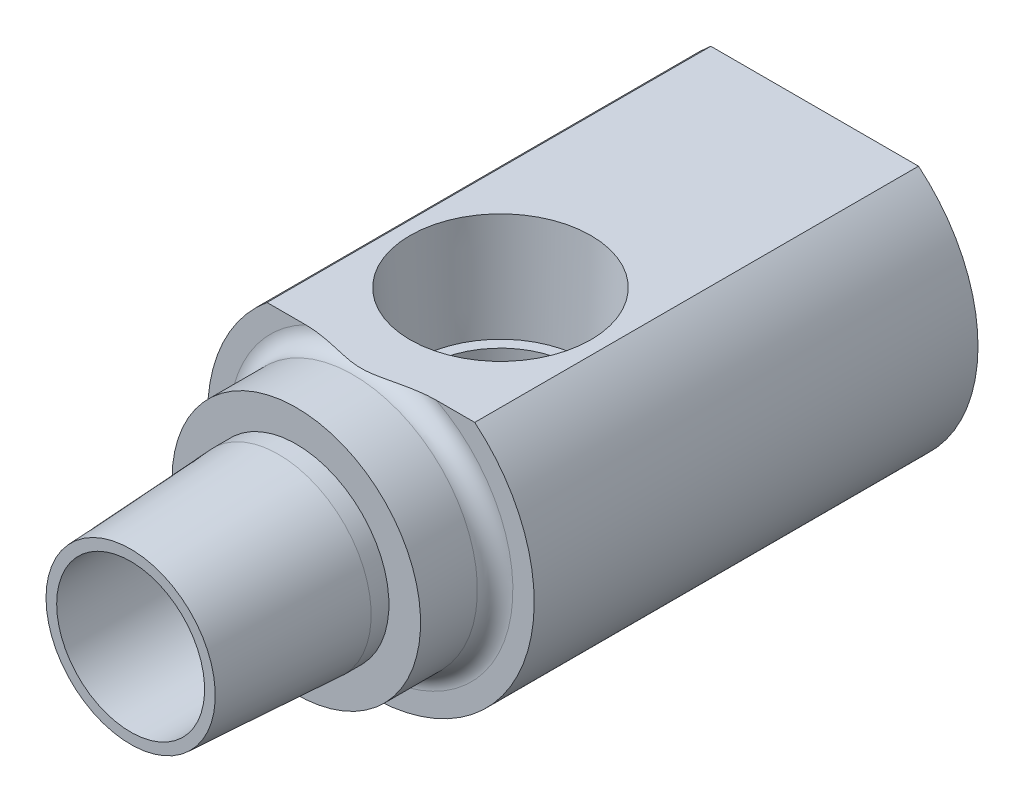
ISO-10303-21;
HEADER;
FILE_DESCRIPTION(('STEP AP214'),'2;1');
FILE_NAME('part.step','',(''),(''),'','','');
FILE_SCHEMA(('AUTOMOTIVE_DESIGN { 1 0 10303 214 1 1 1 1 }'));
ENDSEC;
DATA;
#1=APPLICATION_CONTEXT('core data for automotive mechanical design processes');
#2=APPLICATION_PROTOCOL_DEFINITION('international standard','automotive_design',2000,#1);
#3=PRODUCT_CONTEXT('',#1,'mechanical');
#4=PRODUCT('Part','Part','',(#3));
#5=PRODUCT_RELATED_PRODUCT_CATEGORY('part','',(#4));
#6=PRODUCT_DEFINITION_FORMATION('','',#4);
#7=PRODUCT_DEFINITION_CONTEXT('part definition',#1,'design');
#8=PRODUCT_DEFINITION('design','',#6,#7);
#9=PRODUCT_DEFINITION_SHAPE('','',#8);
#10=(LENGTH_UNIT() NAMED_UNIT(*) SI_UNIT(.MILLI.,.METRE.));
#11=(NAMED_UNIT(*) PLANE_ANGLE_UNIT() SI_UNIT($,.RADIAN.));
#12=(NAMED_UNIT(*) SI_UNIT($,.STERADIAN.) SOLID_ANGLE_UNIT());
#13=UNCERTAINTY_MEASURE_WITH_UNIT(LENGTH_MEASURE(1.E-05),#10,'distance_accuracy_value','');
#14=(GEOMETRIC_REPRESENTATION_CONTEXT(3) GLOBAL_UNCERTAINTY_ASSIGNED_CONTEXT((#13)) GLOBAL_UNIT_ASSIGNED_CONTEXT((#10,
#11,#12)) REPRESENTATION_CONTEXT('',''));
#15=CARTESIAN_POINT('',(0.,0.,0.));
#16=DIRECTION('',(0.,0.,1.));
#17=DIRECTION('',(1.,0.,0.));
#18=AXIS2_PLACEMENT_3D('',#15,#16,#17);
#19=CARTESIAN_POINT('',(-3.175,0.,-7.112));
#20=DIRECTION('',(0.,0.,1.));
#21=DIRECTION('',(1.,0.,0.));
#22=AXIS2_PLACEMENT_3D('',#19,#20,#21);
#23=PLANE('',#22);
#24=CARTESIAN_POINT('',(0.,0.,-7.112));
#25=DIRECTION('',(0.,0.,-1.));
#26=DIRECTION('',(-1.,0.,0.));
#27=AXIS2_PLACEMENT_3D('',#24,#25,#26);
#28=CIRCLE('',#27,3.175);
#29=CARTESIAN_POINT('',(-3.175,0.,-7.112));
#30=VERTEX_POINT('',#29);
#31=EDGE_CURVE('E245',#30,#30,#28,.T.);
#32=ORIENTED_EDGE('',*,*,#31,.F.);
#33=EDGE_LOOP('',(#32));
#34=FACE_BOUND('',#33,.T.);
#35=CARTESIAN_POINT('',(0.,-0.206790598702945,-7.112));
#36=DIRECTION('',(0.,0.,1.));
#37=DIRECTION('',(0.,1.,0.));
#38=AXIS2_PLACEMENT_3D('',#35,#36,#37);
#39=ELLIPSE('',#38,2.91070678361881,2.77750646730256);
#40=CARTESIAN_POINT('',(0.,2.70391618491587,-7.112));
#41=VERTEX_POINT('',#40);
#42=EDGE_CURVE('E191',#41,#41,#39,.F.);
#43=ORIENTED_EDGE('',*,*,#42,.T.);
#44=EDGE_LOOP('',(#43));
#45=FACE_BOUND('',#44,.T.);
#46=ADVANCED_FACE('F16',(#34,#45),#23,.T.);
#47=CARTESIAN_POINT('',(-3.9751,0.,-7.112));
#48=DIRECTION('',(0.,0.,1.));
#49=DIRECTION('',(1.,0.,0.));
#50=AXIS2_PLACEMENT_3D('',#47,#48,#49);
#51=PLANE('',#50);
#52=CARTESIAN_POINT('',(0.,0.,-7.112));
#53=DIRECTION('',(0.,0.,-1.));
#54=DIRECTION('',(-1.,0.,0.));
#55=AXIS2_PLACEMENT_3D('',#52,#53,#54);
#56=CIRCLE('',#55,3.9751);
#57=CARTESIAN_POINT('',(-3.9751,0.,-7.112));
#58=VERTEX_POINT('',#57);
#59=EDGE_CURVE('E189',#58,#58,#56,.T.);
#60=ORIENTED_EDGE('',*,*,#59,.T.);
#61=EDGE_LOOP('',(#60));
#62=FACE_BOUND('',#61,.T.);
#63=CARTESIAN_POINT('',(0.,0.,-7.112));
#64=DIRECTION('',(0.,0.,-1.));
#65=DIRECTION('',(-1.,0.,0.));
#66=AXIS2_PLACEMENT_3D('',#63,#64,#65);
#67=CIRCLE('',#66,5.334);
#68=CARTESIAN_POINT('',(-5.334,0.,-7.112));
#69=VERTEX_POINT('',#68);
#70=EDGE_CURVE('E260',#69,#69,#67,.T.);
#71=ORIENTED_EDGE('',*,*,#70,.F.);
#72=EDGE_LOOP('',(#71));
#73=FACE_BOUND('',#72,.T.);
#74=ADVANCED_FACE('F18',(#62,#73),#51,.T.);
#75=CARTESIAN_POINT('',(0.,0.,-75.1971669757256));
#76=DIRECTION('',(0.,0.,-1.));
#77=DIRECTION('',(-1.,0.,0.));
#78=AXIS2_PLACEMENT_3D('',#75,#76,#77);
#79=CYLINDRICAL_SURFACE('',#78,3.9751);
#80=CARTESIAN_POINT('',(0.,0.,-6.35));
#81=DIRECTION('',(0.,0.,-1.));
#82=DIRECTION('',(-1.,0.,0.));
#83=AXIS2_PLACEMENT_3D('',#80,#81,#82);
#84=CIRCLE('',#83,3.9751);
#85=CARTESIAN_POINT('',(-3.9751,0.,-6.35));
#86=VERTEX_POINT('',#85);
#87=EDGE_CURVE('E235',#86,#86,#84,.T.);
#88=ORIENTED_EDGE('',*,*,#87,.T.);
#89=EDGE_LOOP('',(#88));
#90=FACE_BOUND('',#89,.T.);
#91=ORIENTED_EDGE('',*,*,#59,.F.);
#92=EDGE_LOOP('',(#91));
#93=FACE_BOUND('',#92,.T.);
#94=ADVANCED_FACE('F222',(#90,#93),#79,.T.);
#95=CARTESIAN_POINT('',(0.,0.,-6.35));
#96=DIRECTION('',(0.,0.,-1.));
#97=DIRECTION('',(-1.,0.,0.));
#98=AXIS2_PLACEMENT_3D('',#95,#96,#97);
#99=CONICAL_SURFACE('',#98,3.9751,0.0538619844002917);
#100=CARTESIAN_POINT('',(0.,0.,0.));
#101=DIRECTION('',(0.,0.,-1.));
#102=DIRECTION('',(-1.,0.,0.));
#103=AXIS2_PLACEMENT_3D('',#100,#101,#102);
#104=CIRCLE('',#103,3.63274526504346);
#105=CARTESIAN_POINT('',(-3.63274526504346,0.,0.));
#106=VERTEX_POINT('',#105);
#107=EDGE_CURVE('E238',#106,#106,#104,.T.);
#108=ORIENTED_EDGE('',*,*,#107,.T.);
#109=EDGE_LOOP('',(#108));
#110=FACE_BOUND('',#109,.T.);
#111=ORIENTED_EDGE('',*,*,#87,.F.);
#112=EDGE_LOOP('',(#111));
#113=FACE_BOUND('',#112,.T.);
#114=ADVANCED_FACE('F219',(#110,#113),#99,.T.);
#115=CARTESIAN_POINT('',(-3.175,0.,0.));
#116=DIRECTION('',(0.,0.,1.));
#117=DIRECTION('',(1.,0.,0.));
#118=AXIS2_PLACEMENT_3D('',#115,#116,#117);
#119=PLANE('',#118);
#120=CARTESIAN_POINT('',(0.,0.,0.));
#121=DIRECTION('',(0.,0.,-1.));
#122=DIRECTION('',(-1.,0.,0.));
#123=AXIS2_PLACEMENT_3D('',#120,#121,#122);
#124=CIRCLE('',#123,3.175);
#125=CARTESIAN_POINT('',(-3.175,0.,0.));
#126=VERTEX_POINT('',#125);
#127=EDGE_CURVE('E240',#126,#126,#124,.T.);
#128=ORIENTED_EDGE('',*,*,#127,.T.);
#129=EDGE_LOOP('',(#128));
#130=FACE_BOUND('',#129,.T.);
#131=ORIENTED_EDGE('',*,*,#107,.F.);
#132=EDGE_LOOP('',(#131));
#133=FACE_BOUND('',#132,.T.);
#134=ADVANCED_FACE('F215',(#130,#133),#119,.T.);
#135=CARTESIAN_POINT('',(0.,0.,-75.1971669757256));
#136=DIRECTION('',(0.,0.,-1.));
#137=DIRECTION('',(-1.,0.,0.));
#138=AXIS2_PLACEMENT_3D('',#135,#136,#137);
#139=CYLINDRICAL_SURFACE('',#138,3.175);
#140=ORIENTED_EDGE('',*,*,#31,.T.);
#141=EDGE_LOOP('',(#140));
#142=FACE_BOUND('',#141,.T.);
#143=ORIENTED_EDGE('',*,*,#127,.F.);
#144=EDGE_LOOP('',(#143));
#145=FACE_BOUND('',#144,.T.);
#146=ADVANCED_FACE('F208',(#142,#145),#139,.F.);
#147=CARTESIAN_POINT('',(-7.0104,0.,-29.3624));
#148=DIRECTION('',(0.,0.,-1.));
#149=DIRECTION('',(-1.,0.,0.));
#150=AXIS2_PLACEMENT_3D('',#147,#148,#149);
#151=PLANE('',#150);
#152=DIRECTION('',(1.,0.,0.));
#153=VECTOR('',#152,1.);
#154=CARTESIAN_POINT('',(-1.83308710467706,3.175,-29.3624));
#155=LINE('',#154,#153);
#156=CARTESIAN_POINT('',(-1.83308710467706,3.175,-29.3624));
#157=VERTEX_POINT('',#156);
#158=CARTESIAN_POINT('',(1.83308710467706,3.175,-29.3624));
#159=VERTEX_POINT('',#158);
#160=EDGE_CURVE('E42',#157,#159,#155,.T.);
#161=ORIENTED_EDGE('',*,*,#160,.F.);
#162=DIRECTION('',(0.5,0.866025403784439,0.));
#163=VECTOR('',#162,1.);
#164=CARTESIAN_POINT('',(-3.66617420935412,0.,-29.3624));
#165=LINE('',#164,#163);
#166=CARTESIAN_POINT('',(-3.66617420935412,0.,-29.3624));
#167=VERTEX_POINT('',#166);
#168=EDGE_CURVE('E286',#167,#157,#165,.T.);
#169=ORIENTED_EDGE('',*,*,#168,.F.);
#170=DIRECTION('',(-0.5,0.866025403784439,0.));
#171=VECTOR('',#170,1.);
#172=CARTESIAN_POINT('',(-1.83308710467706,-3.175,-29.3624));
#173=LINE('',#172,#171);
#174=CARTESIAN_POINT('',(-1.83308710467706,-3.175,-29.3624));
#175=VERTEX_POINT('',#174);
#176=EDGE_CURVE('E290',#175,#167,#173,.T.);
#177=ORIENTED_EDGE('',*,*,#176,.F.);
#178=DIRECTION('',(-1.,0.,0.));
#179=VECTOR('',#178,1.);
#180=CARTESIAN_POINT('',(1.83308710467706,-3.175,-29.3624));
#181=LINE('',#180,#179);
#182=CARTESIAN_POINT('',(1.83308710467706,-3.175,-29.3624));
#183=VERTEX_POINT('',#182);
#184=EDGE_CURVE('E293',#183,#175,#181,.T.);
#185=ORIENTED_EDGE('',*,*,#184,.F.);
#186=DIRECTION('',(-0.5,-0.866025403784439,0.));
#187=VECTOR('',#186,1.);
#188=CARTESIAN_POINT('',(3.66617420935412,0.,-29.3624));
#189=LINE('',#188,#187);
#190=CARTESIAN_POINT('',(3.66617420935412,0.,-29.3624));
#191=VERTEX_POINT('',#190);
#192=EDGE_CURVE('E296',#191,#183,#189,.T.);
#193=ORIENTED_EDGE('',*,*,#192,.F.);
#194=DIRECTION('',(0.5,-0.866025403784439,0.));
#195=VECTOR('',#194,1.);
#196=CARTESIAN_POINT('',(1.83308710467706,3.175,-29.3624));
#197=LINE('',#196,#195);
#198=EDGE_CURVE('E299',#159,#191,#197,.T.);
#199=ORIENTED_EDGE('',*,*,#198,.F.);
#200=EDGE_LOOP('',(#161,#169,#177,#185,#193,#199));
#201=FACE_BOUND('',#200,.T.);
#202=DIRECTION('',(-1.,0.,0.));
#203=VECTOR('',#202,1.);
#204=CARTESIAN_POINT('',(-4.4577,5.41060244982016,-29.3624));
#205=LINE('',#204,#203);
#206=CARTESIAN_POINT('',(4.4577,5.41060244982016,-29.3624));
#207=VERTEX_POINT('',#206);
#208=CARTESIAN_POINT('',(-4.4577,5.41060244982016,-29.3624));
#209=VERTEX_POINT('',#208);
#210=EDGE_CURVE('E269',#207,#209,#205,.T.);
#211=ORIENTED_EDGE('',*,*,#210,.F.);
#212=CARTESIAN_POINT('',(0.,0.,-29.3624));
#213=DIRECTION('',(0.,0.,-1.));
#214=DIRECTION('',(-1.,0.,0.));
#215=AXIS2_PLACEMENT_3D('',#212,#213,#214);
#216=CIRCLE('',#215,7.0104);
#217=EDGE_CURVE('E248',#207,#209,#216,.T.);
#218=ORIENTED_EDGE('',*,*,#217,.T.);
#219=EDGE_LOOP('',(#211,#218));
#220=FACE_BOUND('',#219,.T.);
#221=ADVANCED_FACE('F204',(#201,#220),#151,.T.);
#222=CARTESIAN_POINT('',(0.,0.,-75.1971669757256));
#223=DIRECTION('',(0.,0.,-1.));
#224=DIRECTION('',(-1.,0.,0.));
#225=AXIS2_PLACEMENT_3D('',#222,#223,#224);
#226=CYLINDRICAL_SURFACE('',#225,7.0104);
#227=DIRECTION('',(0.,0.,-1.));
#228=VECTOR('',#227,1.);
#229=CARTESIAN_POINT('',(-4.4577,5.41060244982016,0.));
#230=LINE('',#229,#228);
#231=CARTESIAN_POINT('',(-4.4577,5.41060244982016,-10.3124));
#232=VERTEX_POINT('',#231);
#233=EDGE_CURVE('E266',#232,#209,#230,.T.);
#234=ORIENTED_EDGE('',*,*,#233,.T.);
#235=ORIENTED_EDGE('',*,*,#217,.F.);
#236=DIRECTION('',(0.,0.,-1.));
#237=VECTOR('',#236,1.);
#238=CARTESIAN_POINT('',(4.4577,5.41060244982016,0.));
#239=LINE('',#238,#237);
#240=CARTESIAN_POINT('',(4.4577,5.41060244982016,-10.3124));
#241=VERTEX_POINT('',#240);
#242=EDGE_CURVE('E267',#241,#207,#239,.T.);
#243=ORIENTED_EDGE('',*,*,#242,.F.);
#244=CARTESIAN_POINT('',(0.,0.,-10.3124));
#245=DIRECTION('',(0.,0.,-1.));
#246=DIRECTION('',(-1.,0.,0.));
#247=AXIS2_PLACEMENT_3D('',#244,#245,#246);
#248=CIRCLE('',#247,7.0104);
#249=EDGE_CURVE('E251',#241,#232,#248,.T.);
#250=ORIENTED_EDGE('',*,*,#249,.T.);
#251=EDGE_LOOP('',(#234,#235,#243,#250));
#252=FACE_BOUND('',#251,.T.);
#253=ADVANCED_FACE('F200',(#252),#226,.T.);
#254=CARTESIAN_POINT('',(-6.096,0.,-10.3124));
#255=DIRECTION('',(0.,0.,1.));
#256=DIRECTION('',(1.,0.,0.));
#257=AXIS2_PLACEMENT_3D('',#254,#255,#256);
#258=PLANE('',#257);
#259=DIRECTION('',(1.,0.,0.));
#260=VECTOR('',#259,1.);
#261=CARTESIAN_POINT('',(-6.096,5.41060244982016,-10.3124));
#262=LINE('',#261,#260);
#263=CARTESIAN_POINT('',(-2.80830858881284,5.41060244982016,-10.3124));
#264=VERTEX_POINT('',#263);
#265=EDGE_CURVE('E263',#232,#264,#262,.T.);
#266=ORIENTED_EDGE('',*,*,#265,.F.);
#267=ORIENTED_EDGE('',*,*,#249,.F.);
#268=CARTESIAN_POINT('',(2.80830858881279,5.41060244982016,-10.3124000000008));
#269=VERTEX_POINT('',#268);
#270=EDGE_CURVE('E264',#269,#241,#262,.T.);
#271=ORIENTED_EDGE('',*,*,#270,.F.);
#272=CARTESIAN_POINT('',(0.,0.,-10.3124));
#273=DIRECTION('',(0.,0.,-1.));
#274=DIRECTION('',(-1.,0.,0.));
#275=AXIS2_PLACEMENT_3D('',#272,#273,#274);
#276=CIRCLE('',#275,6.096);
#277=EDGE_CURVE('E254',#269,#264,#276,.T.);
#278=ORIENTED_EDGE('',*,*,#277,.T.);
#279=EDGE_LOOP('',(#266,#267,#271,#278));
#280=FACE_BOUND('',#279,.T.);
#281=ADVANCED_FACE('F196',(#280),#258,.T.);
#282=CARTESIAN_POINT('',(0.,0.,-9.5504));
#283=DIRECTION('',(0.,0.,-1.));
#284=DIRECTION('',(-1.,0.,0.));
#285=AXIS2_PLACEMENT_3D('',#282,#283,#284);
#286=TOROIDAL_SURFACE('',#285,6.096,0.762);
#287=CARTESIAN_POINT('',(0.,5.41060244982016,-9.8833777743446));
#288=CARTESIAN_POINT('',(0.0521470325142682,5.41060244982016,-9.88336622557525));
#289=CARTESIAN_POINT('',(0.104287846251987,5.41060244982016,-9.88494210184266));
#290=CARTESIAN_POINT('',(0.208401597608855,5.41060244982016,-9.89103164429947));
#291=CARTESIAN_POINT('',(0.260374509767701,5.41060244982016,-9.89554573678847));
#292=CARTESIAN_POINT('',(0.416241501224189,5.41060244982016,-9.91284832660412));
#293=CARTESIAN_POINT('',(0.519704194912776,5.41060244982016,-9.92939143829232));
#294=CARTESIAN_POINT('',(0.726918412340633,5.41060244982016,-9.96801986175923));
#295=CARTESIAN_POINT('',(0.830655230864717,5.41060244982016,-9.99017646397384));
#296=CARTESIAN_POINT('',(1.03759009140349,5.41060244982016,-10.0362404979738));
#297=CARTESIAN_POINT('',(1.14078865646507,5.41060244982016,-10.0601456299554));
#298=CARTESIAN_POINT('',(1.34834228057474,5.41060244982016,-10.1076053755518));
#299=CARTESIAN_POINT('',(1.4526986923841,5.41060244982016,-10.1311541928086));
#300=CARTESIAN_POINT('',(1.66197970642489,5.41060244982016,-10.175860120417));
#301=CARTESIAN_POINT('',(1.76690452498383,5.41060244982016,-10.1970162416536));
#302=CARTESIAN_POINT('',(1.97693672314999,5.41060244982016,-10.2352529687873));
#303=CARTESIAN_POINT('',(2.08204009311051,5.41060244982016,-10.2523548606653));
#304=CARTESIAN_POINT('',(2.29298648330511,5.41060244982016,-10.2810452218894));
#305=CARTESIAN_POINT('',(2.39882937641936,5.41060244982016,-10.2926346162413));
#306=CARTESIAN_POINT('',(2.63825679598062,5.41060244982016,-10.3105707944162));
#307=CARTESIAN_POINT('',(2.77203238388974,5.41060244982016,-10.3148268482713));
#308=CARTESIAN_POINT('',(2.97236053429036,5.41060244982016,-10.3091542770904));
#309=CARTESIAN_POINT('',(3.03908464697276,5.41060244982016,-10.3052533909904));
#310=CARTESIAN_POINT('',(3.17206397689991,5.41060244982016,-10.292650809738));
#311=CARTESIAN_POINT('',(3.2383194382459,5.41060244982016,-10.2839518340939));
#312=CARTESIAN_POINT('',(3.37725624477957,5.41060244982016,-10.25951512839));
#313=CARTESIAN_POINT('',(3.44982215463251,5.41060244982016,-10.24309575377));
#314=CARTESIAN_POINT('',(3.59245961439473,5.41060244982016,-10.2014714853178));
#315=CARTESIAN_POINT('',(3.6625332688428,5.41060244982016,-10.1762742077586));
#316=CARTESIAN_POINT('',(3.77900159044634,5.41060244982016,-10.1234231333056));
#317=CARTESIAN_POINT('',(3.82657256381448,5.41060244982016,-10.0983897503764));
#318=CARTESIAN_POINT('',(3.91754959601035,5.41060244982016,-10.041584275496));
#319=CARTESIAN_POINT('',(3.96096325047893,5.41060244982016,-10.0098248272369));
#320=CARTESIAN_POINT('',(4.02798010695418,5.41060244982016,-9.95029070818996));
#321=CARTESIAN_POINT('',(4.05342428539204,5.41060244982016,-9.92459895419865));
#322=CARTESIAN_POINT('',(4.10009948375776,5.41060244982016,-9.86961585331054));
#323=CARTESIAN_POINT('',(4.12133630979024,5.41060244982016,-9.84032955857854));
#324=CARTESIAN_POINT('',(4.15466127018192,5.41060244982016,-9.78428761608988));
#325=CARTESIAN_POINT('',(4.16772173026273,5.41060244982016,-9.75811424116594));
#326=CARTESIAN_POINT('',(4.18933719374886,5.41060244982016,-9.70395677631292));
#327=CARTESIAN_POINT('',(4.19789541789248,5.41060244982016,-9.67597399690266));
#328=CARTESIAN_POINT('',(4.20987180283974,5.41060244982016,-9.61873424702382));
#329=CARTESIAN_POINT('',(4.21325884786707,5.41060244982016,-9.58947064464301));
#330=CARTESIAN_POINT('',(4.21447858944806,5.41060244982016,-9.53082898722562));
#331=CARTESIAN_POINT('',(4.21231242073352,5.41060244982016,-9.50145095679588));
#332=CARTESIAN_POINT('',(4.20309810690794,5.41060244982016,-9.44636463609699));
#333=CARTESIAN_POINT('',(4.19653350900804,5.41060244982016,-9.42057293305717));
#334=CARTESIAN_POINT('',(4.17948851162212,5.41060244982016,-9.37033011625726));
#335=CARTESIAN_POINT('',(4.16900680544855,5.41060244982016,-9.34587945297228));
#336=CARTESIAN_POINT('',(4.14035818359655,5.41060244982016,-9.29025200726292));
#337=CARTESIAN_POINT('',(4.12078333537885,5.41060244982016,-9.25980126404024));
#338=CARTESIAN_POINT('',(4.07697861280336,5.41060244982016,-9.20246009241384));
#339=CARTESIAN_POINT('',(4.05273917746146,5.41060244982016,-9.17557717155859));
#340=CARTESIAN_POINT('',(3.98868725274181,5.41060244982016,-9.11355610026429));
#341=CARTESIAN_POINT('',(3.94690497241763,5.41060244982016,-9.080464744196));
#342=CARTESIAN_POINT('',(3.85879527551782,5.41060244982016,-9.02109366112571));
#343=CARTESIAN_POINT('',(3.81245915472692,5.41060244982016,-8.99482734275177));
#344=CARTESIAN_POINT('',(3.7245267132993,5.41060244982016,-8.95184585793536));
#345=CARTESIAN_POINT('',(3.68333828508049,5.41060244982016,-8.93427731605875));
#346=CARTESIAN_POINT('',(3.59958587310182,5.41060244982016,-8.90276046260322));
#347=CARTESIAN_POINT('',(3.55702092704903,5.41060244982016,-8.88881474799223));
#348=CARTESIAN_POINT('',(3.42786902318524,5.41060244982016,-8.85169021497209));
#349=CARTESIAN_POINT('',(3.33991210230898,5.41060244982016,-8.83326351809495));
#350=CARTESIAN_POINT('',(3.16528158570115,5.41060244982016,-8.80664033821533));
#351=CARTESIAN_POINT('',(3.07864723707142,5.41060244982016,-8.7981567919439));
#352=CARTESIAN_POINT('',(2.90489485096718,5.41060244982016,-8.78853139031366));
#353=CARTESIAN_POINT('',(2.8177763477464,5.41060244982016,-8.78739862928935));
#354=CARTESIAN_POINT('',(2.64327811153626,5.41060244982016,-8.79105046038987));
#355=CARTESIAN_POINT('',(2.55589913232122,5.41060244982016,-8.79586348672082));
#356=CARTESIAN_POINT('',(2.38166962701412,5.41060244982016,-8.81026497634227));
#357=CARTESIAN_POINT('',(2.29481855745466,5.41060244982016,-8.81984715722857));
#358=CARTESIAN_POINT('',(2.01384766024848,5.41060244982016,-8.85707093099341));
#359=CARTESIAN_POINT('',(1.82076533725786,5.41060244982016,-8.89234569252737));
#360=CARTESIAN_POINT('',(1.53229430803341,5.41060244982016,-8.95228462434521));
#361=CARTESIAN_POINT('',(1.43609183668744,5.41060244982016,-8.97349691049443));
#362=CARTESIAN_POINT('',(1.24390982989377,5.41060244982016,-9.01693418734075));
#363=CARTESIAN_POINT('',(1.14793028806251,5.41060244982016,-9.03915914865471));
#364=CARTESIAN_POINT('',(0.957697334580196,5.41060244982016,-9.0824933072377));
#365=CARTESIAN_POINT('',(0.863446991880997,5.41060244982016,-9.10361583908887));
#366=CARTESIAN_POINT('',(0.674290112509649,5.41060244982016,-9.14294449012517));
#367=CARTESIAN_POINT('',(0.579383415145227,5.41060244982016,-9.16114986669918));
#368=CARTESIAN_POINT('',(0.389272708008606,5.41060244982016,-9.19115341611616));
#369=CARTESIAN_POINT('',(0.294077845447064,5.41060244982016,-9.20300397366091));
#370=CARTESIAN_POINT('',(0.15079180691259,5.41060244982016,-9.21353954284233));
#371=CARTESIAN_POINT('',(0.102969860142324,5.41060244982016,-9.21584529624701));
#372=CARTESIAN_POINT('',(0.0072742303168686,5.41060244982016,-9.21784449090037));
#373=CARTESIAN_POINT('',(-0.0405994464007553,5.41060244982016,-9.2175382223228));
#374=CARTESIAN_POINT('',(-0.136934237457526,5.41060244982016,-9.21431711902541));
#375=CARTESIAN_POINT('',(-0.185394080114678,5.41060244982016,-9.21136543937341));
#376=CARTESIAN_POINT('',(-0.282118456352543,5.41060244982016,-9.20308955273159));
#377=CARTESIAN_POINT('',(-0.330382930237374,5.41060244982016,-9.19776466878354));
#378=CARTESIAN_POINT('',(-0.475151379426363,5.41060244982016,-9.17884930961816));
#379=CARTESIAN_POINT('',(-0.571263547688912,5.41060244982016,-9.16233640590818));
#380=CARTESIAN_POINT('',(-0.764047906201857,5.41060244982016,-9.12496585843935));
#381=CARTESIAN_POINT('',(-0.860707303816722,5.41060244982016,-9.10404748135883));
#382=CARTESIAN_POINT('',(-1.05357295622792,5.41060244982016,-9.06085991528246));
#383=CARTESIAN_POINT('',(-1.1497796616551,5.41060244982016,-9.03859270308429));
#384=CARTESIAN_POINT('',(-1.36433899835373,5.41060244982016,-8.98954401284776));
#385=CARTESIAN_POINT('',(-1.48272280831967,5.41060244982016,-8.96289520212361));
#386=CARTESIAN_POINT('',(-1.72029970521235,5.41060244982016,-8.91297309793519));
#387=CARTESIAN_POINT('',(-1.83949323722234,5.41060244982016,-8.88970185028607));
#388=CARTESIAN_POINT('',(-2.07789765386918,5.41060244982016,-8.84899103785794));
#389=CARTESIAN_POINT('',(-2.19710038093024,5.41060244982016,-8.83150521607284));
#390=CARTESIAN_POINT('',(-2.43636519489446,5.41060244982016,-8.80446389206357));
#391=CARTESIAN_POINT('',(-2.55642644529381,5.41060244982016,-8.79490151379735));
#392=CARTESIAN_POINT('',(-2.76780194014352,5.41060244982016,-8.78756409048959));
#393=CARTESIAN_POINT('',(-2.85902659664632,5.41060244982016,-8.78749285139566));
#394=CARTESIAN_POINT('',(-3.04144991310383,5.41060244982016,-8.79515186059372));
#395=CARTESIAN_POINT('',(-3.13264774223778,5.41060244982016,-8.80290456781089));
#396=CARTESIAN_POINT('',(-3.31458996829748,5.41060244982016,-8.82848619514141));
#397=CARTESIAN_POINT('',(-3.40532344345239,5.41060244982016,-8.84640255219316));
#398=CARTESIAN_POINT('',(-3.53857286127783,5.41060244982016,-8.88309892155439));
#399=CARTESIAN_POINT('',(-3.58245316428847,5.41060244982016,-8.89694110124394));
#400=CARTESIAN_POINT('',(-3.6688305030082,5.41060244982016,-8.92838510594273));
#401=CARTESIAN_POINT('',(-3.71132868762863,5.41060244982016,-8.94598371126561));
#402=CARTESIAN_POINT('',(-3.79234387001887,5.41060244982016,-8.98457819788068));
#403=CARTESIAN_POINT('',(-3.83095410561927,5.41060244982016,-9.00537576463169));
#404=CARTESIAN_POINT('',(-3.90549335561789,5.41060244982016,-9.05148100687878));
#405=CARTESIAN_POINT('',(-3.94141935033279,5.41060244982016,-9.07679365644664));
#406=CARTESIAN_POINT('',(-4.00964525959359,5.41060244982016,-9.13279277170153));
#407=CARTESIAN_POINT('',(-4.04189445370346,5.41060244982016,-9.16354222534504));
#408=CARTESIAN_POINT('',(-4.10014383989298,5.41060244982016,-9.23048494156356));
#409=CARTESIAN_POINT('',(-4.12616464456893,5.41060244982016,-9.26665958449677));
#410=CARTESIAN_POINT('',(-4.16162371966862,5.41060244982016,-9.33016031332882));
#411=CARTESIAN_POINT('',(-4.17366550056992,5.41060244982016,-9.35603381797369));
#412=CARTESIAN_POINT('',(-4.19334521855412,5.41060244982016,-9.40941407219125));
#413=CARTESIAN_POINT('',(-4.20098675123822,5.41060244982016,-9.43691946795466));
#414=CARTESIAN_POINT('',(-4.21130602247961,5.41060244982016,-9.49300948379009));
#415=CARTESIAN_POINT('',(-4.21395773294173,5.41060244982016,-9.52159897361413));
#416=CARTESIAN_POINT('',(-4.21398264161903,5.41060244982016,-9.57878062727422));
#417=CARTESIAN_POINT('',(-4.21135613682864,5.41060244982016,-9.60737279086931));
#418=CARTESIAN_POINT('',(-4.20143815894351,5.41060244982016,-9.66155976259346));
#419=CARTESIAN_POINT('',(-4.1945008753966,5.41060244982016,-9.68722109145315));
#420=CARTESIAN_POINT('',(-4.17676949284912,5.41060244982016,-9.73716185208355));
#421=CARTESIAN_POINT('',(-4.1659739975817,5.41060244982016,-9.76144077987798));
#422=CARTESIAN_POINT('',(-4.13643456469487,5.41060244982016,-9.81706409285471));
#423=CARTESIAN_POINT('',(-4.11622825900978,5.41060244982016,-9.84763117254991));
#424=CARTESIAN_POINT('',(-4.07115731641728,5.41060244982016,-9.90510927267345));
#425=CARTESIAN_POINT('',(-4.04628281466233,5.41060244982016,-9.93201233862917));
#426=CARTESIAN_POINT('',(-3.98047143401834,5.41060244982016,-9.99419695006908));
#427=CARTESIAN_POINT('',(-3.93753463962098,5.41060244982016,-10.0273489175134));
#428=CARTESIAN_POINT('',(-3.84713170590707,5.41060244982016,-10.0866768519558));
#429=CARTESIAN_POINT('',(-3.79965701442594,5.41060244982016,-10.1128392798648));
#430=CARTESIAN_POINT('',(-3.70945527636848,5.41060244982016,-10.1556191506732));
#431=CARTESIAN_POINT('',(-3.66712202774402,5.41060244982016,-10.1730859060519));
#432=CARTESIAN_POINT('',(-3.58109351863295,5.41060244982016,-10.2043030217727));
#433=CARTESIAN_POINT('',(-3.53739729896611,5.41060244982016,-10.218050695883));
#434=CARTESIAN_POINT('',(-3.4048693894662,5.41060244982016,-10.2544695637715));
#435=CARTESIAN_POINT('',(-3.3146965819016,5.41060244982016,-10.2722735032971));
#436=CARTESIAN_POINT('',(-3.13512177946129,5.41060244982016,-10.2975720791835));
#437=CARTESIAN_POINT('',(-3.04574747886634,5.41060244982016,-10.3052878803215));
#438=CARTESIAN_POINT('',(-2.86659161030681,5.41060244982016,-10.3131574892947));
#439=CARTESIAN_POINT('',(-2.77680968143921,5.41060244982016,-10.3133021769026));
#440=CARTESIAN_POINT('',(-2.59707026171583,5.41060244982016,-10.3075298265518));
#441=CARTESIAN_POINT('',(-2.5071138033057,5.41060244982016,-10.3015854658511));
#442=CARTESIAN_POINT('',(-2.32777785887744,5.41060244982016,-10.2848498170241));
#443=CARTESIAN_POINT('',(-2.23839782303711,5.41060244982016,-10.2740641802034));
#444=CARTESIAN_POINT('',(-1.96748151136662,5.41060244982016,-10.2354986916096));
#445=CARTESIAN_POINT('',(-1.78682109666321,5.41060244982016,-10.2017132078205));
#446=CARTESIAN_POINT('',(-1.51682052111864,5.41060244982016,-10.1451135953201));
#447=CARTESIAN_POINT('',(-1.42679945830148,5.41060244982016,-10.1252126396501));
#448=CARTESIAN_POINT('',(-1.24695389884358,5.41060244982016,-10.0845437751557));
#449=CARTESIAN_POINT('',(-1.1571293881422,5.41060244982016,-10.0637759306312));
#450=CARTESIAN_POINT('',(-0.979057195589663,5.41060244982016,-10.0231394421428));
#451=CARTESIAN_POINT('',(-0.890811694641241,5.41060244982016,-10.003261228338));
#452=CARTESIAN_POINT('',(-0.713780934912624,5.41060244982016,-9.96580183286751));
#453=CARTESIAN_POINT('',(-0.624995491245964,5.41060244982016,-9.9482214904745));
#454=CARTESIAN_POINT('',(-0.447203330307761,5.41060244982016,-9.91806015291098));
#455=CARTESIAN_POINT('',(-0.35820314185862,5.41060244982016,-9.90544303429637));
#456=CARTESIAN_POINT('',(-0.1794617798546,5.41060244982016,-9.88811676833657));
#457=CARTESIAN_POINT('',(-0.08972168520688,5.41060244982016,-9.88339764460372));
#458=CARTESIAN_POINT('',(0.,5.41060244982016,-9.8833777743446));
#459=B_SPLINE_CURVE_WITH_KNOTS('',3,(#287,#288,#289,#290,#291,#292,#293,#294,#295,#296,#297,
#298,#299,#300,#301,#302,#303,#304,#305,#306,#307,#308,#309,#310,#311,#312,#313,#314,#315,#316,
#317,#318,#319,#320,#321,#322,#323,#324,#325,#326,#327,#328,#329,#330,#331,#332,#333,#334,#335,
#336,#337,#338,#339,#340,#341,#342,#343,#344,#345,#346,#347,#348,#349,#350,#351,#352,#353,#354,
#355,#356,#357,#358,#359,#360,#361,#362,#363,#364,#365,#366,#367,#368,#369,#370,#371,#372,#373,
#374,#375,#376,#377,#378,#379,#380,#381,#382,#383,#384,#385,#386,#387,#388,#389,#390,#391,#392,
#393,#394,#395,#396,#397,#398,#399,#400,#401,#402,#403,#404,#405,#406,#407,#408,#409,#410,#411,
#412,#413,#414,#415,#416,#417,#418,#419,#420,#421,#422,#423,#424,#425,#426,#427,#428,#429,#430,
#431,#432,#433,#434,#435,#436,#437,#438,#439,#440,#441,#442,#443,#444,#445,#446,#447,#448,#449,
#450,#451,#452,#453,#454,#455,#456,#457,#458),.UNSPECIFIED.,.T.,.F.,(4,2,2,2,2,2,2,2,2,2,2,2,2,
2,2,2,2,2,2,2,2,2,2,2,2,2,2,2,2,2,2,2,2,2,2,2,2,2,2,2,2,2,2,2,2,2,2,2,2,2,2,2,2,2,2,2,2,2,2,2,2,
2,2,2,2,2,2,2,2,2,2,2,2,2,2,2,2,2,2,2,2,2,2,2,2,4),(0.,0.156408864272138,0.312840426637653,
0.626836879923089,0.945040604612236,1.2628330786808,1.5837652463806,1.90482960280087,
2.22416896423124,2.54345472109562,2.9441659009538,3.14454518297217,3.34481100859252,
3.56760205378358,3.79020027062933,3.95104939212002,4.11159879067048,4.21974493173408,
4.32774077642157,4.41514397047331,4.50248455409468,4.59034863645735,4.67819476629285,
4.75769203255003,4.83721584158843,4.94521135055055,5.05343062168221,5.21243854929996,
5.37175654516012,5.5059015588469,5.64014246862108,5.90890810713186,6.16970670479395,
6.43082789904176,6.69320268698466,6.95523275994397,7.54340798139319,7.83896772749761,
8.13451890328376,8.4242729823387,8.71410070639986,9.0015010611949,9.14506775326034,
9.28861849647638,9.43420020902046,9.57982347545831,9.87216797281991,10.1688428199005,
10.4650929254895,10.8291174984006,11.1933616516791,11.5546188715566,11.9155622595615,
12.1889721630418,12.4631691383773,12.7397615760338,12.8776619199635,13.0154445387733,
13.1467577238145,13.2782164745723,13.4113120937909,13.5439609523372,13.6292456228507,
13.7144605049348,13.8001186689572,13.885772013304,13.9651785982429,14.0446139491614,
14.1539273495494,14.2634744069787,14.4253063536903,14.5874495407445,14.7246386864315,
14.8619266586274,15.1368206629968,15.4055810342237,15.6746651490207,15.9449620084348,
16.2149441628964,16.7658370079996,17.0424344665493,17.319011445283,17.5903768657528,
17.8618411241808,18.131291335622,18.4004009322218),.UNSPECIFIED.);
#460=EDGE_CURVE('E110',#264,#269,#459,.T.);
#461=ORIENTED_EDGE('',*,*,#460,.F.);
#462=ORIENTED_EDGE('',*,*,#277,.F.);
#463=EDGE_LOOP('',(#461,#462));
#464=FACE_BOUND('',#463,.T.);
#465=CARTESIAN_POINT('',(0.,0.,-9.5504));
#466=DIRECTION('',(0.,0.,-1.));
#467=DIRECTION('',(-1.,0.,0.));
#468=AXIS2_PLACEMENT_3D('',#465,#466,#467);
#469=CIRCLE('',#468,5.334);
#470=CARTESIAN_POINT('',(-5.334,0.,-9.5504));
#471=VERTEX_POINT('',#470);
#472=EDGE_CURVE('E257',#471,#471,#469,.T.);
#473=ORIENTED_EDGE('',*,*,#472,.T.);
#474=EDGE_LOOP('',(#473));
#475=FACE_BOUND('',#474,.T.);
#476=ADVANCED_FACE('F192',(#464,#475),#286,.F.);
#477=CARTESIAN_POINT('',(0.,0.,-75.1971669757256));
#478=DIRECTION('',(0.,0.,-1.));
#479=DIRECTION('',(-1.,0.,0.));
#480=AXIS2_PLACEMENT_3D('',#477,#478,#479);
#481=CYLINDRICAL_SURFACE('',#480,5.334);
#482=ORIENTED_EDGE('',*,*,#70,.T.);
#483=EDGE_LOOP('',(#482));
#484=FACE_BOUND('',#483,.T.);
#485=ORIENTED_EDGE('',*,*,#472,.F.);
#486=EDGE_LOOP('',(#485));
#487=FACE_BOUND('',#486,.T.);
#488=ADVANCED_FACE('F182',(#484,#487),#481,.T.);
#489=CARTESIAN_POINT('',(-4.4577,5.41060244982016,0.));
#490=DIRECTION('',(0.,-1.,0.));
#491=DIRECTION('',(0.,0.,-1.));
#492=AXIS2_PLACEMENT_3D('',#489,#490,#491);
#493=PLANE('',#492);
#494=CARTESIAN_POINT('',(0.,5.41060244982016,-15.875));
#495=DIRECTION('',(0.,-1.,0.));
#496=DIRECTION('',(0.,0.,-1.));
#497=AXIS2_PLACEMENT_3D('',#494,#495,#496);
#498=CIRCLE('',#497,3.8800785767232);
#499=CARTESIAN_POINT('',(0.,5.41060244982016,-19.7550785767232));
#500=VERTEX_POINT('',#499);
#501=EDGE_CURVE('E511',#500,#500,#498,.T.);
#502=ORIENTED_EDGE('',*,*,#501,.T.);
#503=EDGE_LOOP('',(#502));
#504=FACE_BOUND('',#503,.T.);
#505=ORIENTED_EDGE('',*,*,#265,.T.);
#506=ORIENTED_EDGE('',*,*,#460,.T.);
#507=ORIENTED_EDGE('',*,*,#270,.T.);
#508=ORIENTED_EDGE('',*,*,#242,.T.);
#509=ORIENTED_EDGE('',*,*,#210,.T.);
#510=ORIENTED_EDGE('',*,*,#233,.F.);
#511=EDGE_LOOP('',(#505,#506,#507,#508,#509,#510));
#512=FACE_BOUND('',#511,.T.);
#513=ADVANCED_FACE('F178',(#504,#512),#493,.F.);
#514=CARTESIAN_POINT('',(-1.83308710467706,3.175,-24.5364));
#515=DIRECTION('',(0.,1.,0.));
#516=DIRECTION('',(-1.,0.,0.));
#517=AXIS2_PLACEMENT_3D('',#514,#515,#516);
#518=PLANE('',#517);
#519=ORIENTED_EDGE('',*,*,#160,.T.);
#520=DIRECTION('',(0.,0.,-1.));
#521=VECTOR('',#520,1.);
#522=CARTESIAN_POINT('',(1.83308710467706,3.175,-24.5364));
#523=LINE('',#522,#521);
#524=CARTESIAN_POINT('',(1.83308710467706,3.175,-24.5364));
#525=VERTEX_POINT('',#524);
#526=EDGE_CURVE('E274',#525,#159,#523,.T.);
#527=ORIENTED_EDGE('',*,*,#526,.F.);
#528=DIRECTION('',(1.,0.,0.));
#529=VECTOR('',#528,1.);
#530=CARTESIAN_POINT('',(-1.83308710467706,3.175,-24.5364));
#531=LINE('',#530,#529);
#532=CARTESIAN_POINT('',(-1.83308710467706,3.175,-24.5364));
#533=VERTEX_POINT('',#532);
#534=EDGE_CURVE('E289',#533,#525,#531,.T.);
#535=ORIENTED_EDGE('',*,*,#534,.F.);
#536=DIRECTION('',(0.,0.,-1.));
#537=VECTOR('',#536,1.);
#538=CARTESIAN_POINT('',(-1.83308710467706,3.175,-24.5364));
#539=LINE('',#538,#537);
#540=EDGE_CURVE('E273',#533,#157,#539,.T.);
#541=ORIENTED_EDGE('',*,*,#540,.T.);
#542=EDGE_LOOP('',(#519,#527,#535,#541));
#543=FACE_BOUND('',#542,.T.);
#544=ADVANCED_FACE('F160',(#543),#518,.F.);
#545=CARTESIAN_POINT('',(-3.66617420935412,0.,-24.5364));
#546=DIRECTION('',(-0.866025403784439,0.5,0.));
#547=DIRECTION('',(-0.5,-0.866025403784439,0.));
#548=AXIS2_PLACEMENT_3D('',#545,#546,#547);
#549=PLANE('',#548);
#550=ORIENTED_EDGE('',*,*,#168,.T.);
#551=ORIENTED_EDGE('',*,*,#540,.F.);
#552=DIRECTION('',(0.5,0.866025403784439,0.));
#553=VECTOR('',#552,1.);
#554=CARTESIAN_POINT('',(-3.66617420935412,0.,-24.5364));
#555=LINE('',#554,#553);
#556=CARTESIAN_POINT('',(-3.66617420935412,0.,-24.5364));
#557=VERTEX_POINT('',#556);
#558=EDGE_CURVE('E277',#557,#533,#555,.T.);
#559=ORIENTED_EDGE('',*,*,#558,.F.);
#560=DIRECTION('',(0.,0.,-1.));
#561=VECTOR('',#560,1.);
#562=CARTESIAN_POINT('',(-3.66617420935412,0.,-24.5364));
#563=LINE('',#562,#561);
#564=EDGE_CURVE('E283',#557,#167,#563,.T.);
#565=ORIENTED_EDGE('',*,*,#564,.T.);
#566=EDGE_LOOP('',(#550,#551,#559,#565));
#567=FACE_BOUND('',#566,.T.);
#568=ADVANCED_FACE('F156',(#567),#549,.F.);
#569=CARTESIAN_POINT('',(-1.83308710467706,-3.175,-24.5364));
#570=DIRECTION('',(-0.866025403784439,-0.5,0.));
#571=DIRECTION('',(0.5,-0.866025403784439,0.));
#572=AXIS2_PLACEMENT_3D('',#569,#570,#571);
#573=PLANE('',#572);
#574=ORIENTED_EDGE('',*,*,#176,.T.);
#575=ORIENTED_EDGE('',*,*,#564,.F.);
#576=DIRECTION('',(-0.5,0.866025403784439,0.));
#577=VECTOR('',#576,1.);
#578=CARTESIAN_POINT('',(-1.83308710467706,-3.175,-24.5364));
#579=LINE('',#578,#577);
#580=CARTESIAN_POINT('',(-1.83308710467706,-3.175,-24.5364));
#581=VERTEX_POINT('',#580);
#582=EDGE_CURVE('E305',#581,#557,#579,.T.);
#583=ORIENTED_EDGE('',*,*,#582,.F.);
#584=DIRECTION('',(0.,0.,-1.));
#585=VECTOR('',#584,1.);
#586=CARTESIAN_POINT('',(-1.83308710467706,-3.175,-24.5364));
#587=LINE('',#586,#585);
#588=EDGE_CURVE('E281',#581,#175,#587,.T.);
#589=ORIENTED_EDGE('',*,*,#588,.T.);
#590=EDGE_LOOP('',(#574,#575,#583,#589));
#591=FACE_BOUND('',#590,.T.);
#592=ADVANCED_FACE('F159',(#591),#573,.F.);
#593=CARTESIAN_POINT('',(1.83308710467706,-3.175,-24.5364));
#594=DIRECTION('',(0.,-1.,0.));
#595=DIRECTION('',(1.,0.,0.));
#596=AXIS2_PLACEMENT_3D('',#593,#594,#595);
#597=PLANE('',#596);
#598=ORIENTED_EDGE('',*,*,#184,.T.);
#599=ORIENTED_EDGE('',*,*,#588,.F.);
#600=DIRECTION('',(-1.,0.,0.));
#601=VECTOR('',#600,1.);
#602=CARTESIAN_POINT('',(1.83308710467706,-3.175,-24.5364));
#603=LINE('',#602,#601);
#604=CARTESIAN_POINT('',(1.83308710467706,-3.175,-24.5364));
#605=VERTEX_POINT('',#604);
#606=EDGE_CURVE('E308',#605,#581,#603,.T.);
#607=ORIENTED_EDGE('',*,*,#606,.F.);
#608=DIRECTION('',(0.,0.,-1.));
#609=VECTOR('',#608,1.);
#610=CARTESIAN_POINT('',(1.83308710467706,-3.175,-24.5364));
#611=LINE('',#610,#609);
#612=EDGE_CURVE('E279',#605,#183,#611,.T.);
#613=ORIENTED_EDGE('',*,*,#612,.T.);
#614=EDGE_LOOP('',(#598,#599,#607,#613));
#615=FACE_BOUND('',#614,.T.);
#616=ADVANCED_FACE('F164',(#615),#597,.F.);
#617=CARTESIAN_POINT('',(3.66617420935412,0.,-24.5364));
#618=DIRECTION('',(0.866025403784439,-0.5,0.));
#619=DIRECTION('',(0.5,0.866025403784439,0.));
#620=AXIS2_PLACEMENT_3D('',#617,#618,#619);
#621=PLANE('',#620);
#622=ORIENTED_EDGE('',*,*,#192,.T.);
#623=ORIENTED_EDGE('',*,*,#612,.F.);
#624=DIRECTION('',(-0.5,-0.866025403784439,0.));
#625=VECTOR('',#624,1.);
#626=CARTESIAN_POINT('',(3.66617420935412,0.,-24.5364));
#627=LINE('',#626,#625);
#628=CARTESIAN_POINT('',(3.66617420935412,0.,-24.5364));
#629=VERTEX_POINT('',#628);
#630=EDGE_CURVE('E311',#629,#605,#627,.T.);
#631=ORIENTED_EDGE('',*,*,#630,.F.);
#632=DIRECTION('',(0.,0.,-1.));
#633=VECTOR('',#632,1.);
#634=CARTESIAN_POINT('',(3.66617420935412,0.,-24.5364));
#635=LINE('',#634,#633);
#636=EDGE_CURVE('E276',#629,#191,#635,.T.);
#637=ORIENTED_EDGE('',*,*,#636,.T.);
#638=EDGE_LOOP('',(#622,#623,#631,#637));
#639=FACE_BOUND('',#638,.T.);
#640=ADVANCED_FACE('F168',(#639),#621,.F.);
#641=CARTESIAN_POINT('',(1.83308710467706,3.175,-24.5364));
#642=DIRECTION('',(0.866025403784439,0.5,0.));
#643=DIRECTION('',(-0.5,0.866025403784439,0.));
#644=AXIS2_PLACEMENT_3D('',#641,#642,#643);
#645=PLANE('',#644);
#646=ORIENTED_EDGE('',*,*,#198,.T.);
#647=ORIENTED_EDGE('',*,*,#636,.F.);
#648=DIRECTION('',(0.5,-0.866025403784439,0.));
#649=VECTOR('',#648,1.);
#650=CARTESIAN_POINT('',(1.83308710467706,3.175,-24.5364));
#651=LINE('',#650,#649);
#652=EDGE_CURVE('E314',#525,#629,#651,.T.);
#653=ORIENTED_EDGE('',*,*,#652,.F.);
#654=ORIENTED_EDGE('',*,*,#526,.T.);
#655=EDGE_LOOP('',(#646,#647,#653,#654));
#656=FACE_BOUND('',#655,.T.);
#657=ADVANCED_FACE('F154',(#656),#645,.F.);
#658=CARTESIAN_POINT('',(0.,0.,-24.5364));
#659=DIRECTION('',(0.,0.,-1.));
#660=DIRECTION('',(-1.,0.,0.));
#661=AXIS2_PLACEMENT_3D('',#658,#659,#660);
#662=PLANE('',#661);
#663=ORIENTED_EDGE('',*,*,#534,.T.);
#664=ORIENTED_EDGE('',*,*,#652,.T.);
#665=ORIENTED_EDGE('',*,*,#630,.T.);
#666=ORIENTED_EDGE('',*,*,#606,.T.);
#667=ORIENTED_EDGE('',*,*,#582,.T.);
#668=ORIENTED_EDGE('',*,*,#558,.T.);
#669=EDGE_LOOP('',(#663,#664,#665,#666,#667,#668));
#670=FACE_BOUND('',#669,.T.);
#671=ADVANCED_FACE('F150',(#670),#662,.T.);
#672=CARTESIAN_POINT('',(0.,-2.98624109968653,-15.8414554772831));
#673=DIRECTION('',(0.,0.298636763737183,0.954366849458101));
#674=DIRECTION('',(0.,-0.954366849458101,0.298636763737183));
#675=AXIS2_PLACEMENT_3D('',#672,#673,#674);
#676=CONICAL_SURFACE('',#675,2.29646041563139,0.826862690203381);
#677=CARTESIAN_POINT('',(-4.07250877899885,-2.19612830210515,-14.3644110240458));
#678=CARTESIAN_POINT('',(-3.92894564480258,-2.29613709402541,-14.4756886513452));
#679=CARTESIAN_POINT('',(-3.7849275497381,-2.39583064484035,-14.5866777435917));
#680=CARTESIAN_POINT('',(-3.49542612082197,-2.59418522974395,-14.8077997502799));
#681=CARTESIAN_POINT('',(-3.34994228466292,-2.69284588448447,-14.9179323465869));
#682=CARTESIAN_POINT('',(-3.05718484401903,-2.88857438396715,-15.1368858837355));
#683=CARTESIAN_POINT('',(-2.90991293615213,-2.98564356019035,-15.2457078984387));
#684=CARTESIAN_POINT('',(-2.61260725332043,-3.17745365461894,-15.4615917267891));
#685=CARTESIAN_POINT('',(-2.46257392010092,-3.27219493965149,-15.5686538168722));
#686=CARTESIAN_POINT('',(-2.30585388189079,-3.36777676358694,-15.6776150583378));
#687=CARTESIAN_POINT('',(-2.30125812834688,-3.37057671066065,-15.6808077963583));
#688=CARTESIAN_POINT('',(-2.18325993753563,-3.44238980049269,-15.7627174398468));
#689=CARTESIAN_POINT('',(-2.0686676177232,-3.51030800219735,-15.8407122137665));
#690=CARTESIAN_POINT('',(-1.89428090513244,-3.60949921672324,-15.9562600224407));
#691=CARTESIAN_POINT('',(-1.83573157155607,-3.64211739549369,-15.9945377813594));
#692=CARTESIAN_POINT('',(-1.71764576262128,-3.70614874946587,-16.0705622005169));
#693=CARTESIAN_POINT('',(-1.65810935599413,-3.73756200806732,-16.1083088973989));
#694=CARTESIAN_POINT('',(-1.50902814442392,-3.81348555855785,-16.2011975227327));
#695=CARTESIAN_POINT('',(-1.41877996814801,-3.85705520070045,-16.256003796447));
#696=CARTESIAN_POINT('',(-1.28105412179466,-3.91788385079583,-16.3377076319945));
#697=CARTESIAN_POINT('',(-1.23473646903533,-3.93741186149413,-16.3648674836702));
#698=CARTESIAN_POINT('',(-1.14132702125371,-3.97432114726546,-16.4193030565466));
#699=CARTESIAN_POINT('',(-1.09423547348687,-3.99170309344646,-16.4465787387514));
#700=CARTESIAN_POINT('',(-0.997307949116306,-4.02406270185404,-16.5030998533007));
#701=CARTESIAN_POINT('',(-0.947443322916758,-4.03889834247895,-16.5323788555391));
#702=CARTESIAN_POINT('',(-0.847763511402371,-4.0631733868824,-16.5932955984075));
#703=CARTESIAN_POINT('',(-0.797948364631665,-4.07262087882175,-16.6249297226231));
#704=CARTESIAN_POINT('',(-0.715255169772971,-4.08120879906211,-16.6833697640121));
#705=CARTESIAN_POINT('',(-0.681720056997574,-4.08256924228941,-16.7088423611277));
#706=CARTESIAN_POINT('',(-0.617985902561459,-4.07965525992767,-16.7632455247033));
#707=CARTESIAN_POINT('',(-0.587772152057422,-4.07540686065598,-16.7921595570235));
#708=CARTESIAN_POINT('',(-0.53221485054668,-4.0614241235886,-16.8531430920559));
#709=CARTESIAN_POINT('',(-0.50687330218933,-4.05168753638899,-16.8852138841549));
#710=CARTESIAN_POINT('',(-0.460853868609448,-4.02824244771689,-16.9513376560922));
#711=CARTESIAN_POINT('',(-0.440201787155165,-4.01451287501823,-16.985400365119));
#712=CARTESIAN_POINT('',(-0.402209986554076,-3.98452453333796,-17.0547272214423));
#713=CARTESIAN_POINT('',(-0.384909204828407,-3.96823960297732,-17.090000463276));
#714=CARTESIAN_POINT('',(-0.3525699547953,-3.93424634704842,-17.16091457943));
#715=CARTESIAN_POINT('',(-0.33753384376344,-3.91653656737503,-17.1965557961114));
#716=CARTESIAN_POINT('',(-0.294316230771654,-3.86219954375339,-17.3036152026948));
#717=CARTESIAN_POINT('',(-0.268029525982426,-3.82436859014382,-17.3751605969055));
#718=CARTESIAN_POINT('',(-0.231716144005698,-3.7724914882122,-17.4716207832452));
#719=CARTESIAN_POINT('',(-0.222113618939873,-3.75880866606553,-17.4969098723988));
#720=CARTESIAN_POINT('',(-0.202474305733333,-3.7314087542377,-17.5472944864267));
#721=CARTESIAN_POINT('',(-0.19243761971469,-3.7176916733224,-17.5723900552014));
#722=CARTESIAN_POINT('',(-0.168352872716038,-3.68618578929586,-17.6298096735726));
#723=CARTESIAN_POINT('',(-0.154009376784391,-3.66841964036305,-17.6620255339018));
#724=CARTESIAN_POINT('',(-0.127399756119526,-3.6394056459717,-17.7144439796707));
#725=CARTESIAN_POINT('',(-0.116086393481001,-3.62799604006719,-17.7350056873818));
#726=CARTESIAN_POINT('',(-0.096796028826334,-3.61145924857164,-17.7647498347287));
#727=CARTESIAN_POINT('',(-0.0899630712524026,-3.60603291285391,-17.7745000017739));
#728=CARTESIAN_POINT('',(-0.0750884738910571,-3.59558512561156,-17.7932567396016));
#729=CARTESIAN_POINT('',(-0.0670533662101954,-3.59056169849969,-17.8022669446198));
#730=CARTESIAN_POINT('',(-0.0548991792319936,-3.58446020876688,-17.8132035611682));
#731=CARTESIAN_POINT('',(-0.051686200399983,-3.58296263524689,-17.8158871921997));
#732=CARTESIAN_POINT('',(-0.0449596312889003,-3.58012842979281,-17.8209650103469));
#733=CARTESIAN_POINT('',(-0.0414456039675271,-3.57879203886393,-17.8233587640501));
#734=CARTESIAN_POINT('',(-0.0340308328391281,-3.57633948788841,-17.8277510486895));
#735=CARTESIAN_POINT('',(-0.0301255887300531,-3.57522647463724,-17.8297439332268));
#736=CARTESIAN_POINT('',(-0.0219697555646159,-3.57335995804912,-17.8330856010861));
#737=CARTESIAN_POINT('',(-0.0177205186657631,-3.57260512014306,-17.8344367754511));
#738=CARTESIAN_POINT('',(-0.0102473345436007,-3.57172497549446,-17.8360121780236));
#739=CARTESIAN_POINT('',(-0.00708274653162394,-3.57148067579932,-17.8364494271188));
#740=CARTESIAN_POINT('',(-0.000714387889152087,-3.57126182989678,-17.8368411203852));
#741=CARTESIAN_POINT('',(0.00248936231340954,-3.57128714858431,-17.8367958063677));
#742=CARTESIAN_POINT('',(0.0088322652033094,-3.57160403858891,-17.8362286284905));
#743=CARTESIAN_POINT('',(0.0119715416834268,-3.57189503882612,-17.8357077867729));
#744=CARTESIAN_POINT('',(0.0181194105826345,-3.57271024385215,-17.8342485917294));
#745=CARTESIAN_POINT('',(0.0211278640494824,-3.57323469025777,-17.833309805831));
#746=CARTESIAN_POINT('',(0.0286013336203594,-3.57481605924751,-17.8304787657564));
#747=CARTESIAN_POINT('',(0.0329459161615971,-3.57600690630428,-17.8283466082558));
#748=CARTESIAN_POINT('',(0.0412158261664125,-3.57869375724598,-17.8235348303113));
#749=CARTESIAN_POINT('',(0.0451398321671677,-3.58019068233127,-17.8208535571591));
#750=CARTESIAN_POINT('',(0.0583057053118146,-3.58579053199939,-17.8108204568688));
#751=CARTESIAN_POINT('',(0.0666020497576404,-3.5904070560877,-17.8025445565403));
#752=CARTESIAN_POINT('',(0.0818753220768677,-3.60012687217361,-17.7851053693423));
#753=CARTESIAN_POINT('',(0.0888422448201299,-3.60523345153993,-17.7759360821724));
#754=CARTESIAN_POINT('',(0.102190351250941,-3.61591467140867,-17.7567390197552));
#755=CARTESIAN_POINT('',(0.108534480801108,-3.6214999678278,-17.7466913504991));
#756=CARTESIAN_POINT('',(0.120595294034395,-3.63282028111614,-17.7263044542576));
#757=CARTESIAN_POINT('',(0.126311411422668,-3.63855542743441,-17.7159649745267));
#758=CARTESIAN_POINT('',(0.142827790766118,-3.65591792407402,-17.6846256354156));
#759=CARTESIAN_POINT('',(0.152966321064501,-3.66767616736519,-17.6633518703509));
#760=CARTESIAN_POINT('',(0.172289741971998,-3.69132323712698,-17.6204415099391));
#761=CARTESIAN_POINT('',(0.181473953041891,-3.70321215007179,-17.5988046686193));
#762=CARTESIAN_POINT('',(0.19926983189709,-3.72700226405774,-17.5553513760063));
#763=CARTESIAN_POINT('',(0.207882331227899,-3.738903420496,-17.5335352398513));
#764=CARTESIAN_POINT('',(0.229463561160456,-3.7691852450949,-17.4777772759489));
#765=CARTESIAN_POINT('',(0.242231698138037,-3.7875408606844,-17.4437453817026));
#766=CARTESIAN_POINT('',(0.267799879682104,-3.82397965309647,-17.3755171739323));
#767=CARTESIAN_POINT('',(0.280599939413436,-3.84206264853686,-17.3413207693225));
#768=CARTESIAN_POINT('',(0.306854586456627,-3.87771318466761,-17.272903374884));
#769=CARTESIAN_POINT('',(0.32030918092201,-3.89528071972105,-17.2386823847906));
#770=CARTESIAN_POINT('',(0.348599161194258,-3.92953632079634,-17.1703841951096));
#771=CARTESIAN_POINT('',(0.363433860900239,-3.94622481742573,-17.1363069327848));
#772=CARTESIAN_POINT('',(0.398407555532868,-3.98114177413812,-17.0622037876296));
#773=CARTESIAN_POINT('',(0.419019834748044,-3.99907733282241,-17.022253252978));
#774=CARTESIAN_POINT('',(0.465471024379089,-4.0310798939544,-16.9440205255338));
#775=CARTESIAN_POINT('',(0.491277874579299,-4.0451694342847,-16.9057297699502));
#776=CARTESIAN_POINT('',(0.545373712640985,-4.06542869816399,-16.8377756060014));
#777=CARTESIAN_POINT('',(0.572759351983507,-4.07245088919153,-16.8076665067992));
#778=CARTESIAN_POINT('',(0.631629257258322,-4.08093258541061,-16.7508082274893));
#779=CARTESIAN_POINT('',(0.663120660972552,-4.0823822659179,-16.7240650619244));
#780=CARTESIAN_POINT('',(0.726968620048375,-4.08040036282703,-16.6746632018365));
#781=CARTESIAN_POINT('',(0.759244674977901,-4.07715530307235,-16.6518865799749));
#782=CARTESIAN_POINT('',(0.824583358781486,-4.06724495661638,-16.6082389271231));
#783=CARTESIAN_POINT('',(0.857647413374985,-4.06057293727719,-16.5873717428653));
#784=CARTESIAN_POINT('',(0.957502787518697,-4.03678737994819,-16.526026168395));
#785=CARTESIAN_POINT('',(1.02438068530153,-4.01595713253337,-16.4871969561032));
#786=CARTESIAN_POINT('',(1.14424359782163,-3.97341603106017,-16.4175927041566));
#787=CARTESIAN_POINT('',(1.19748827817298,-3.95259799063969,-16.3866691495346));
#788=CARTESIAN_POINT('',(1.30297042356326,-3.90857902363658,-16.3247826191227));
#789=CARTESIAN_POINT('',(1.35520787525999,-3.88537806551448,-16.2938196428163));
#790=CARTESIAN_POINT('',(1.45878040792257,-3.83727954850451,-16.2315444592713));
#791=CARTESIAN_POINT('',(1.51011420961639,-3.81237979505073,-16.2002318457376));
#792=CARTESIAN_POINT('',(1.61192451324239,-3.76133809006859,-16.1372239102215));
#793=CARTESIAN_POINT('',(1.66240096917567,-3.73519607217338,-16.1055285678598));
#794=CARTESIAN_POINT('',(1.8123785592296,-3.6555426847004,-16.0100678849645));
#795=CARTESIAN_POINT('',(1.91076959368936,-3.60064013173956,-15.9457218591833));
#796=CARTESIAN_POINT('',(2.10527415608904,-3.48854629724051,-15.8157541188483));
#797=CARTESIAN_POINT('',(2.20138879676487,-3.43135617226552,-15.7501330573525));
#798=CARTESIAN_POINT('',(2.30778939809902,-3.3666018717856,-15.6762740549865));
#799=CARTESIAN_POINT('',(2.31890687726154,-3.35981809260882,-15.6685417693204));
#800=CARTESIAN_POINT('',(2.34111888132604,-3.3462298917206,-15.6530638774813));
#801=CARTESIAN_POINT('',(2.3522134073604,-3.33942547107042,-15.6453182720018));
#802=CARTESIAN_POINT('',(2.36329704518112,-3.33261086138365,-15.6375659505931));
#803=B_SPLINE_CURVE_WITH_KNOTS('',3,(#677,#678,#679,#680,#681,#682,#683,#684,#685,#686,#687,
#688,#689,#690,#691,#692,#693,#694,#695,#696,#697,#698,#699,#700,#701,#702,#703,#704,#705,#706,
#707,#708,#709,#710,#711,#712,#713,#714,#715,#716,#717,#718,#719,#720,#721,#722,#723,#724,#725,
#726,#727,#728,#729,#730,#731,#732,#733,#734,#735,#736,#737,#738,#739,#740,#741,#742,#743,#744,
#745,#746,#747,#748,#749,#750,#751,#752,#753,#754,#755,#756,#757,#758,#759,#760,#761,#762,#763,
#764,#765,#766,#767,#768,#769,#770,#771,#772,#773,#774,#775,#776,#777,#778,#779,#780,#781,#782,
#783,#784,#785,#786,#787,#788,#789,#790,#791,#792,#793,#794,#795,#796,#797,#798,#799,#800,#801,
#802),.UNSPECIFIED.,.F.,.F.,(4,2,2,2,2,2,2,2,2,2,2,2,2,2,2,2,2,2,2,2,2,2,2,2,2,2,2,2,2,2,2,2,2,
2,2,2,2,2,2,2,2,2,2,2,2,2,2,2,2,2,2,2,2,2,2,2,2,2,2,2,2,2,4),(0.,0.622067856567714,
1.24435668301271,1.86609517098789,2.48773504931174,2.50650707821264,2.96951057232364,
3.20104373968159,3.43256085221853,3.77506503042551,3.94643820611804,4.11775765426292,
4.29672726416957,4.47542751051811,4.60135076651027,4.72669175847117,4.85208416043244,
4.97815065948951,5.10560397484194,5.23318905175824,5.48838992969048,5.57933478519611,
5.67025836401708,5.78866806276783,5.86680365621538,5.90602976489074,5.94504999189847,
5.95837186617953,5.97171341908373,5.98523144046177,5.99869869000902,6.00826669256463,
6.01782990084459,6.0273726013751,6.03692520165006,6.05179036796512,6.06670095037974,
6.10419109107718,6.14195312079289,6.181306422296,6.22069492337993,6.29965579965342,
6.37867252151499,6.45757167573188,6.5797299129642,6.70196612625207,6.82420367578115,
6.94638077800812,7.09133454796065,7.23541969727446,7.35860022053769,7.48199781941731,
7.6006253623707,7.71948685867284,7.95928812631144,8.15425409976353,8.3492226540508,
8.54444802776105,8.73968384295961,9.12886253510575,9.51784689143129,9.56328539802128,
9.60872160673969),.UNSPECIFIED.);
#804=CARTESIAN_POINT('',(-2.25549871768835,-3.39834193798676,-15.7125024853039));
#805=VERTEX_POINT('',#804);
#806=CARTESIAN_POINT('',(2.25549871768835,-3.39834193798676,-15.7125024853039));
#807=VERTEX_POINT('',#806);
#808=EDGE_CURVE('E115',#805,#807,#803,.T.);
#809=ORIENTED_EDGE('',*,*,#808,.F.);
#810=CARTESIAN_POINT('',(0.,-2.98624109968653,-15.8414554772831));
#811=DIRECTION('',(0.,-0.298636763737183,-0.954366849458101));
#812=DIRECTION('',(0.,0.954366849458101,-0.298636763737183));
#813=AXIS2_PLACEMENT_3D('',#810,#811,#812);
#814=CIRCLE('',#813,2.29646041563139);
#815=EDGE_CURVE('E122',#807,#805,#814,.T.);
#816=ORIENTED_EDGE('',*,*,#815,.F.);
#817=EDGE_LOOP('',(#809,#816));
#818=FACE_BOUND('',#817,.T.);
#819=CARTESIAN_POINT('',(0.,-3.61740950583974,-17.8585085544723));
#820=VERTEX_POINT('',#819);
#821=VERTEX_LOOP('',#820);
#822=FACE_BOUND('',#821,.T.);
#823=ADVANCED_FACE('F146',(#818,#822),#676,.F.);
#824=CARTESIAN_POINT('',(0.,0.10005952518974,-5.97842666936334));
#825=DIRECTION('',(0.,0.298636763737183,0.954366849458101));
#826=DIRECTION('',(0.,-0.954366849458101,0.298636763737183));
#827=AXIS2_PLACEMENT_3D('',#824,#825,#826);
#828=CONICAL_SURFACE('',#827,2.83954893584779,0.0525020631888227);
#829=CARTESIAN_POINT('',(2.25182818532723,-3.35036202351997,-16.5274629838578));
#830=CARTESIAN_POINT('',(2.25288853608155,-3.35830343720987,-16.4743814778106));
#831=CARTESIAN_POINT('',(2.25364641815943,-3.36545931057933,-16.4211778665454));
#832=CARTESIAN_POINT('',(2.25472371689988,-3.37800256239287,-16.3145443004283));
#833=CARTESIAN_POINT('',(2.25504301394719,-3.38338945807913,-16.2611142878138));
#834=CARTESIAN_POINT('',(2.2555924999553,-3.39659879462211,-16.1005022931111));
#835=CARTESIAN_POINT('',(2.25541356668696,-3.40146166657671,-15.9930507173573));
#836=CARTESIAN_POINT('',(2.25532962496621,-3.40208473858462,-15.7803221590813));
#837=CARTESIAN_POINT('',(2.25541905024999,-3.3980303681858,-15.6750459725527));
#838=CARTESIAN_POINT('',(2.25685593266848,-3.38099709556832,-15.4653202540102));
#839=CARTESIAN_POINT('',(2.25820234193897,-3.36802562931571,-15.3608701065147));
#840=CARTESIAN_POINT('',(2.26317892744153,-3.32968516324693,-15.1271982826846));
#841=CARTESIAN_POINT('',(2.26729922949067,-3.302015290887,-14.9983692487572));
#842=CARTESIAN_POINT('',(2.27808749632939,-3.23678674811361,-14.743164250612));
#843=CARTESIAN_POINT('',(2.2847606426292,-3.1992080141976,-14.616793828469));
#844=CARTESIAN_POINT('',(2.30013752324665,-3.11589214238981,-14.3629706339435));
#845=CARTESIAN_POINT('',(2.30889330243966,-3.06995449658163,-14.2355881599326));
#846=CARTESIAN_POINT('',(2.32285889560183,-2.99733775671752,-14.0463644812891));
#847=CARTESIAN_POINT('',(2.32764087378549,-2.9725746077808,-13.983739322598));
#848=CARTESIAN_POINT('',(2.33740882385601,-2.92198880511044,-13.8589513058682));
#849=CARTESIAN_POINT('',(2.34239474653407,-2.89616640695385,-13.7967883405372));
#850=CARTESIAN_POINT('',(2.347444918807,-2.86990957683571,-13.7348144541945));
#851=B_SPLINE_CURVE_WITH_KNOTS('',3,(#829,#830,#831,#832,#833,#834,#835,#836,#837,#838,#839,
#840,#841,#842,#843,#844,#845,#846,#847,#848,#849,#850),.UNSPECIFIED.,.F.,.F.,(4,2,2,2,2,2,2,2,
2,2,4),(0.,0.161036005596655,0.32211592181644,0.644434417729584,0.960113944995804,
1.27553054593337,1.67045549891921,2.06618632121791,2.47309805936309,2.67563006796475,
2.87811349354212),.UNSPECIFIED.);
#852=CARTESIAN_POINT('',(2.34740644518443,-2.87010957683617,-13.7352864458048));
#853=VERTEX_POINT('',#852);
#854=EDGE_CURVE('E10',#807,#853,#851,.T.);
#855=ORIENTED_EDGE('',*,*,#854,.F.);
#856=ORIENTED_EDGE('',*,*,#815,.T.);
#857=CARTESIAN_POINT('',(-2.347444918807,-2.86990957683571,-13.7348144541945));
#858=CARTESIAN_POINT('',(-2.34073943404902,-2.90477830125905,-13.81715602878));
#859=CARTESIAN_POINT('',(-2.33414026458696,-2.93890888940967,-13.8998345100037));
#860=CARTESIAN_POINT('',(-2.32134513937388,-3.00519305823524,-14.0660788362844));
#861=CARTESIAN_POINT('',(-2.31514948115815,-3.03734517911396,-14.1496452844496));
#862=CARTESIAN_POINT('',(-2.303305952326,-3.09941465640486,-14.3185632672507));
#863=CARTESIAN_POINT('',(-2.29766388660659,-3.12930770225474,-14.4039242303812));
#864=CARTESIAN_POINT('',(-2.28723787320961,-3.18577335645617,-14.5757838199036));
#865=CARTESIAN_POINT('',(-2.28245377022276,-3.21234656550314,-14.6622822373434));
#866=CARTESIAN_POINT('',(-2.27414278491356,-3.26035165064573,-14.8331761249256));
#867=CARTESIAN_POINT('',(-2.27057462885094,-3.2819419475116,-14.9175245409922));
#868=CARTESIAN_POINT('',(-2.26460266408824,-3.32036680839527,-15.0873343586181));
#869=CARTESIAN_POINT('',(-2.26219858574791,-3.33720247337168,-15.1727954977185));
#870=CARTESIAN_POINT('',(-2.25856439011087,-3.36527251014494,-15.3443120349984));
#871=CARTESIAN_POINT('',(-2.25732953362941,-3.37652940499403,-15.4303635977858));
#872=CARTESIAN_POINT('',(-2.2557877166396,-3.39303892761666,-15.6030341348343));
#873=CARTESIAN_POINT('',(-2.25548050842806,-3.39829315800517,-15.6896529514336));
#874=CARTESIAN_POINT('',(-2.25532788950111,-3.40214505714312,-15.8386888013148));
#875=CARTESIAN_POINT('',(-2.25537704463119,-3.40219739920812,-15.901073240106));
#876=CARTESIAN_POINT('',(-2.25545627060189,-3.39932986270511,-16.0258199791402));
#877=CARTESIAN_POINT('',(-2.25548632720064,-3.39640777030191,-16.0881822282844));
#878=CARTESIAN_POINT('',(-2.25525889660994,-3.38776149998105,-16.2135738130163));
#879=CARTESIAN_POINT('',(-2.25499742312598,-3.3819990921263,-16.2766004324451));
#880=CARTESIAN_POINT('',(-2.25390645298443,-3.36797501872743,-16.4022996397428));
#881=CARTESIAN_POINT('',(-2.25307759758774,-3.35971618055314,-16.4649725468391));
#882=CARTESIAN_POINT('',(-2.25182818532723,-3.35036202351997,-16.5274629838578));
#883=B_SPLINE_CURVE_WITH_KNOTS('',3,(#857,#858,#859,#860,#861,#862,#863,#864,#865,#866,#867,
#868,#869,#870,#871,#872,#873,#874,#875,#876,#877,#878,#879,#880,#881,#882),.UNSPECIFIED.,.F.,
.F.,(4,2,2,2,2,2,2,2,2,2,2,2,4),(0.,0.269031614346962,0.538259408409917,0.81006174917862,
1.0818148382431,1.34311705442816,1.60435871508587,1.86453689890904,2.12464560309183,
2.31172983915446,2.4989534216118,2.68876878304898,2.87836996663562),.UNSPECIFIED.);
#884=CARTESIAN_POINT('',(-2.34740644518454,-2.87010957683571,-13.7352864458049));
#885=VERTEX_POINT('',#884);
#886=EDGE_CURVE('E29',#885,#805,#883,.T.);
#887=ORIENTED_EDGE('',*,*,#886,.F.);
#888=CARTESIAN_POINT('',(2.34736035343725,-2.87030957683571,-13.7352358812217));
#889=CARTESIAN_POINT('',(2.35935096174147,-2.81836861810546,-13.7484079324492));
#890=CARTESIAN_POINT('',(2.36955576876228,-2.76556742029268,-13.7598077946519));
#891=CARTESIAN_POINT('',(2.38643778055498,-2.65879148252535,-13.7788634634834));
#892=CARTESIAN_POINT('',(2.39311826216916,-2.60481788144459,-13.7865227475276));
#893=CARTESIAN_POINT('',(2.40295103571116,-2.49687797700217,-13.7978459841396));
#894=CARTESIAN_POINT('',(2.40614967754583,-2.44292138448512,-13.8015624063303));
#895=CARTESIAN_POINT('',(2.40933042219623,-2.33479615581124,-13.8052605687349));
#896=CARTESIAN_POINT('',(2.40931213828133,-2.28062749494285,-13.8052418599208));
#897=CARTESIAN_POINT('',(2.4047310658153,-2.11885558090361,-13.7999079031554));
#898=CARTESIAN_POINT('',(2.39568105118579,-2.01151554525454,-13.7893603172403));
#899=CARTESIAN_POINT('',(2.36727614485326,-1.79968302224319,-13.7571883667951));
#900=CARTESIAN_POINT('',(2.34788097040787,-1.69520335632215,-13.7355207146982));
#901=CARTESIAN_POINT('',(2.30360144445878,-1.50514867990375,-13.6879909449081));
#902=CARTESIAN_POINT('',(2.27991010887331,-1.41901828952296,-13.6631825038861));
#903=CARTESIAN_POINT('',(2.22649703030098,-1.24993829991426,-13.6094232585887));
#904=CARTESIAN_POINT('',(2.19677131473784,-1.1669908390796,-13.5804697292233));
#905=CARTESIAN_POINT('',(2.13148440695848,-1.00421560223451,-13.519695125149));
#906=CARTESIAN_POINT('',(2.09590648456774,-0.924397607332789,-13.4878659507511));
#907=CARTESIAN_POINT('',(2.01906267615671,-0.768301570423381,-13.4225273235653));
#908=CARTESIAN_POINT('',(1.97779813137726,-0.692022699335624,-13.3890182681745));
#909=CARTESIAN_POINT('',(1.88746165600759,-0.539809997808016,-13.3196984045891));
#910=CARTESIAN_POINT('',(1.83811906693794,-0.464051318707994,-13.2838523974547));
#911=CARTESIAN_POINT('',(1.73292194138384,-0.317139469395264,-13.2123460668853));
#912=CARTESIAN_POINT('',(1.67706538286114,-0.245987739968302,-13.1766858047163));
#913=CARTESIAN_POINT('',(1.49966241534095,-0.0409551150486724,-13.0716947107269));
#914=CARTESIAN_POINT('',(1.36777414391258,0.0853857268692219,-13.0039362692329));
#915=CARTESIAN_POINT('',(1.13793556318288,0.259841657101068,-12.9081866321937));
#916=CARTESIAN_POINT('',(1.04966554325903,0.318276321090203,-12.8755979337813));
#917=CARTESIAN_POINT('',(0.863843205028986,0.422505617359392,-12.8169068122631));
#918=CARTESIAN_POINT('',(0.766295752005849,0.468306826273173,-12.7908010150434));
#919=CARTESIAN_POINT('',(0.562109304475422,0.544532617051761,-12.7471055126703));
#920=CARTESIAN_POINT('',(0.455379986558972,0.574777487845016,-12.7296154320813));
#921=CARTESIAN_POINT('',(0.237083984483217,0.616054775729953,-12.7056986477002));
#922=CARTESIAN_POINT('',(0.125524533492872,0.627114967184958,-12.6992559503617));
#923=CARTESIAN_POINT('',(-0.0810957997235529,0.628689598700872,-12.6983386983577));
#924=CARTESIAN_POINT('',(-0.176140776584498,0.622017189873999,-12.7022254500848));
#925=CARTESIAN_POINT('',(-0.363442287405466,0.594503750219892,-12.7181920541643));
#926=CARTESIAN_POINT('',(-0.455697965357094,0.573658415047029,-12.7302743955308));
#927=CARTESIAN_POINT('',(-0.632689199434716,0.520120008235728,-12.7611169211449));
#928=CARTESIAN_POINT('',(-0.717559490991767,0.487756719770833,-12.7796909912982));
#929=CARTESIAN_POINT('',(-0.881231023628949,0.412984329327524,-12.8222496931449));
#930=CARTESIAN_POINT('',(-0.960030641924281,0.370572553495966,-12.8462357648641));
#931=CARTESIAN_POINT('',(-1.15620941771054,0.249640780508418,-12.913891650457));
#932=CARTESIAN_POINT('',(-1.26851788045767,0.16468477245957,-12.9607609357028));
#933=CARTESIAN_POINT('',(-1.47664976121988,-0.0207858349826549,-13.0604678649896));
#934=CARTESIAN_POINT('',(-1.57241648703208,-0.121351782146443,-13.1133250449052));
#935=CARTESIAN_POINT('',(-1.72107321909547,-0.301360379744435,-13.2044824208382));
#936=CARTESIAN_POINT('',(-1.77807680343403,-0.377749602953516,-13.2422434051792));
#937=CARTESIAN_POINT('',(-1.88493793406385,-0.535489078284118,-13.3176614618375));
#938=CARTESIAN_POINT('',(-1.93479175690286,-0.616841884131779,-13.355318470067));
#939=CARTESIAN_POINT('',(-2.02752677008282,-0.783988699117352,-13.4293218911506));
#940=CARTESIAN_POINT('',(-2.07040808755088,-0.86978262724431,-13.4656683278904));
#941=CARTESIAN_POINT('',(-2.14920097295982,-1.04550024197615,-13.5356830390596));
#942=CARTESIAN_POINT('',(-2.18511626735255,-1.13542168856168,-13.5693527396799));
#943=CARTESIAN_POINT('',(-2.25970868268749,-1.3474804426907,-13.6420923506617));
#944=CARTESIAN_POINT('',(-2.29586336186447,-1.47105045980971,-13.6796583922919));
#945=CARTESIAN_POINT('',(-2.35444364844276,-1.72428944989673,-13.7425928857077));
#946=CARTESIAN_POINT('',(-2.37690771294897,-1.85394022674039,-13.7679954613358));
#947=CARTESIAN_POINT('',(-2.40214898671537,-2.08660166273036,-13.7968635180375));
#948=CARTESIAN_POINT('',(-2.40830070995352,-2.18875498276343,-13.8040689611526));
#949=CARTESIAN_POINT('',(-2.40946497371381,-2.3931911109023,-13.8054119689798));
#950=CARTESIAN_POINT('',(-2.404500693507,-2.49547320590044,-13.7995767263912));
#951=CARTESIAN_POINT('',(-2.38840239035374,-2.6426894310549,-13.7811353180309));
#952=CARTESIAN_POINT('',(-2.38201974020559,-2.68889392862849,-13.773855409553));
#953=CARTESIAN_POINT('',(-2.36664917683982,-2.78037193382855,-13.7565583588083));
#954=CARTESIAN_POINT('',(-2.35765999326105,-2.82564497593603,-13.7465398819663));
#955=CARTESIAN_POINT('',(-2.34736035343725,-2.87030957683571,-13.7352358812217));
#956=B_SPLINE_CURVE_WITH_KNOTS('',3,(#888,#889,#890,#891,#892,#893,#894,#895,#896,#897,#898,
#899,#900,#901,#902,#903,#904,#905,#906,#907,#908,#909,#910,#911,#912,#913,#914,#915,#916,#917,
#918,#919,#920,#921,#922,#923,#924,#925,#926,#927,#928,#929,#930,#931,#932,#933,#934,#935,#936,
#937,#938,#939,#940,#941,#942,#943,#944,#945,#946,#947,#948,#949,#950,#951,#952,#953,#954,#955),
.UNSPECIFIED.,.F.,.F.,(4,2,2,2,2,2,2,2,2,2,2,2,2,2,2,2,2,2,2,2,2,2,2,2,2,2,2,2,2,2,2,2,2,4),(0.,
0.164666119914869,0.329178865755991,0.491473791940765,0.653788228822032,0.977013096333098,
1.30150584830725,1.57926003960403,1.85719767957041,2.13594415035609,2.41462498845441,
2.70604440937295,2.99755453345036,3.5773091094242,3.90859191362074,4.23970193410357,
4.57455565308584,4.90892418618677,5.1935225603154,5.47820740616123,5.75532218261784,
6.03251078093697,6.47526975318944,6.91951728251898,7.22672664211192,7.53409541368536,
7.8414585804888,8.14865686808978,8.54993126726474,8.95007322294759,9.25667646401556,
9.56264096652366,9.70412496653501,9.84567803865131),.UNSPECIFIED.);
#957=EDGE_CURVE('E104',#853,#885,#956,.T.);
#958=ORIENTED_EDGE('',*,*,#957,.F.);
#959=EDGE_LOOP('',(#855,#856,#887,#958));
#960=FACE_BOUND('',#959,.T.);
#961=ORIENTED_EDGE('',*,*,#42,.F.);
#962=EDGE_LOOP('',(#961));
#963=FACE_BOUND('',#962,.T.);
#964=ADVANCED_FACE('F119',(#960,#963),#828,.F.);
#965=CARTESIAN_POINT('',(0.,-4.70392991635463,-15.875));
#966=DIRECTION('',(0.,1.,0.));
#967=DIRECTION('',(0.,0.,1.));
#968=AXIS2_PLACEMENT_3D('',#965,#966,#967);
#969=CONICAL_SURFACE('',#968,0.,1.0471975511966);
#970=ORIENTED_EDGE('',*,*,#854,.T.);
#971=CARTESIAN_POINT('',(0.,-2.87010957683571,-15.875));
#972=DIRECTION('',(0.,-1.,0.));
#973=DIRECTION('',(0.,0.,-1.));
#974=AXIS2_PLACEMENT_3D('',#971,#972,#973);
#975=CIRCLE('',#974,3.17627);
#976=EDGE_CURVE('E35',#885,#853,#975,.T.);
#977=ORIENTED_EDGE('',*,*,#976,.F.);
#978=ORIENTED_EDGE('',*,*,#886,.T.);
#979=ORIENTED_EDGE('',*,*,#808,.T.);
#980=EDGE_LOOP('',(#970,#977,#978,#979));
#981=FACE_BOUND('',#980,.T.);
#982=ADVANCED_FACE('F113',(#981),#969,.F.);
#983=CARTESIAN_POINT('',(0.,5.41060244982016,-15.875));
#984=DIRECTION('',(0.,-1.,0.));
#985=DIRECTION('',(0.,0.,-1.));
#986=AXIS2_PLACEMENT_3D('',#983,#984,#985);
#987=CYLINDRICAL_SURFACE('',#986,3.17627);
#988=ORIENTED_EDGE('',*,*,#957,.T.);
#989=ORIENTED_EDGE('',*,*,#976,.T.);
#990=EDGE_LOOP('',(#988,#989));
#991=FACE_BOUND('',#990,.T.);
#992=CARTESIAN_POINT('',(0.,0.915609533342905,-15.875));
#993=DIRECTION('',(0.,-1.,0.));
#994=DIRECTION('',(0.,0.,-1.));
#995=AXIS2_PLACEMENT_3D('',#992,#993,#994);
#996=CIRCLE('',#995,3.17627);
#997=CARTESIAN_POINT('',(0.,0.915609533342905,-19.05127));
#998=VERTEX_POINT('',#997);
#999=EDGE_CURVE('E116',#998,#998,#996,.T.);
#1000=ORIENTED_EDGE('',*,*,#999,.F.);
#1001=EDGE_LOOP('',(#1000));
#1002=FACE_BOUND('',#1001,.T.);
#1003=ADVANCED_FACE('F105',(#991,#1002),#987,.F.);
#1004=CARTESIAN_POINT('',(0.,0.915609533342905,-19.5190897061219));
#1005=DIRECTION('',(0.,-1.,0.));
#1006=DIRECTION('',(0.,0.,-1.));
#1007=AXIS2_PLACEMENT_3D('',#1004,#1005,#1006);
#1008=PLANE('',#1007);
#1009=CARTESIAN_POINT('',(0.,0.915609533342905,-15.875));
#1010=DIRECTION('',(0.,-1.,0.));
#1011=DIRECTION('',(0.,0.,-1.));
#1012=AXIS2_PLACEMENT_3D('',#1009,#1010,#1011);
#1013=CIRCLE('',#1012,3.64408970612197);
#1014=CARTESIAN_POINT('',(0.,0.915609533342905,-19.519089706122));
#1015=VERTEX_POINT('',#1014);
#1016=EDGE_CURVE('E514',#1015,#1015,#1013,.T.);
#1017=ORIENTED_EDGE('',*,*,#1016,.F.);
#1018=EDGE_LOOP('',(#1017));
#1019=FACE_BOUND('',#1018,.T.);
#1020=ORIENTED_EDGE('',*,*,#999,.T.);
#1021=EDGE_LOOP('',(#1020));
#1022=FACE_BOUND('',#1021,.T.);
#1023=ADVANCED_FACE('F417',(#1019,#1022),#1008,.F.);
#1024=CARTESIAN_POINT('',(0.,0.915609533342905,-15.875));
#1025=DIRECTION('',(0.,1.,0.));
#1026=DIRECTION('',(0.,0.,1.));
#1027=AXIS2_PLACEMENT_3D('',#1024,#1025,#1026);
#1028=CONICAL_SURFACE('',#1027,3.64408970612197,0.052452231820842);
#1029=ORIENTED_EDGE('',*,*,#501,.F.);
#1030=EDGE_LOOP('',(#1029));
#1031=FACE_BOUND('',#1030,.T.);
#1032=ORIENTED_EDGE('',*,*,#1016,.T.);
#1033=EDGE_LOOP('',(#1032));
#1034=FACE_BOUND('',#1033,.T.);
#1035=ADVANCED_FACE('F424',(#1031,#1034),#1028,.F.);
#1036=CLOSED_SHELL('',(#46,#74,#94,#114,#134,#146,#221,#253,#281,#476,#488,#513,#544,#568,#592,
#616,#640,#657,#671,#823,#964,#982,#1003,#1023,#1035));
#1037=MANIFOLD_SOLID_BREP('B1',#1036);
#1038=ADVANCED_BREP_SHAPE_REPRESENTATION('',(#18,#1037),#14);
#1039=SHAPE_DEFINITION_REPRESENTATION(#9,#1038);
ENDSEC;
END-ISO-10303-21;
